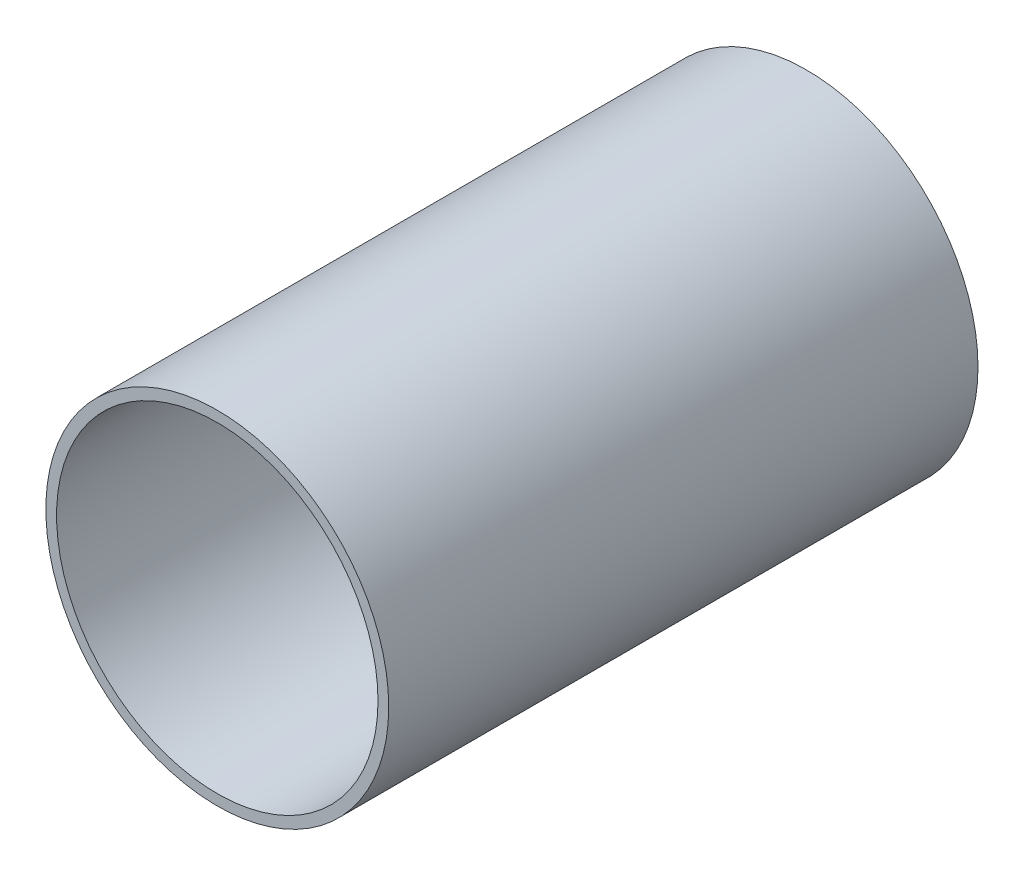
ISO-10303-21;
HEADER;
FILE_DESCRIPTION(('STEP AP214'),'2;1');
FILE_NAME('part.step','',(''),(''),'','','');
FILE_SCHEMA(('AUTOMOTIVE_DESIGN { 1 0 10303 214 1 1 1 1 }'));
ENDSEC;
DATA;
#1=APPLICATION_CONTEXT('core data for automotive mechanical design processes');
#2=APPLICATION_PROTOCOL_DEFINITION('international standard','automotive_design',2000,#1);
#3=PRODUCT_CONTEXT('',#1,'mechanical');
#4=PRODUCT('Part','Part','',(#3));
#5=PRODUCT_RELATED_PRODUCT_CATEGORY('part','',(#4));
#6=PRODUCT_DEFINITION_FORMATION('','',#4);
#7=PRODUCT_DEFINITION_CONTEXT('part definition',#1,'design');
#8=PRODUCT_DEFINITION('design','',#6,#7);
#9=PRODUCT_DEFINITION_SHAPE('','',#8);
#10=(LENGTH_UNIT() NAMED_UNIT(*) SI_UNIT(.MILLI.,.METRE.));
#11=(NAMED_UNIT(*) PLANE_ANGLE_UNIT() SI_UNIT($,.RADIAN.));
#12=(NAMED_UNIT(*) SI_UNIT($,.STERADIAN.) SOLID_ANGLE_UNIT());
#13=UNCERTAINTY_MEASURE_WITH_UNIT(LENGTH_MEASURE(1.E-05),#10,'distance_accuracy_value','');
#14=(GEOMETRIC_REPRESENTATION_CONTEXT(3) GLOBAL_UNCERTAINTY_ASSIGNED_CONTEXT((#13)) GLOBAL_UNIT_ASSIGNED_CONTEXT((#10,
#11,#12)) REPRESENTATION_CONTEXT('',''));
#15=CARTESIAN_POINT('',(0.,0.,0.));
#16=DIRECTION('',(0.,0.,1.));
#17=DIRECTION('',(1.,0.,0.));
#18=AXIS2_PLACEMENT_3D('',#15,#16,#17);
#19=CARTESIAN_POINT('',(0.,0.,22.));
#20=DIRECTION('',(0.,0.,1.));
#21=DIRECTION('',(1.,0.,0.));
#22=AXIS2_PLACEMENT_3D('',#19,#20,#21);
#23=PLANE('',#22);
#24=CARTESIAN_POINT('',(0.,0.,22.));
#25=DIRECTION('',(0.,0.,1.));
#26=DIRECTION('',(1.,0.,0.));
#27=AXIS2_PLACEMENT_3D('',#24,#25,#26);
#28=CIRCLE('',#27,6.4);
#29=CARTESIAN_POINT('',(6.4,0.,22.));
#30=VERTEX_POINT('',#29);
#31=EDGE_CURVE('E11',#30,#30,#28,.T.);
#32=ORIENTED_EDGE('',*,*,#31,.T.);
#33=EDGE_LOOP('',(#32));
#34=FACE_BOUND('',#33,.T.);
#35=CARTESIAN_POINT('',(0.,0.,22.));
#36=DIRECTION('',(0.,0.,1.));
#37=DIRECTION('',(1.,0.,0.));
#38=AXIS2_PLACEMENT_3D('',#35,#36,#37);
#39=CIRCLE('',#38,6.);
#40=CARTESIAN_POINT('',(6.,0.,22.));
#41=VERTEX_POINT('',#40);
#42=EDGE_CURVE('E47',#41,#41,#39,.T.);
#43=ORIENTED_EDGE('',*,*,#42,.F.);
#44=EDGE_LOOP('',(#43));
#45=FACE_BOUND('',#44,.T.);
#46=ADVANCED_FACE('F36',(#34,#45),#23,.T.);
#47=CARTESIAN_POINT('',(0.,0.,0.));
#48=DIRECTION('',(0.,0.,1.));
#49=DIRECTION('',(1.,0.,0.));
#50=AXIS2_PLACEMENT_3D('',#47,#48,#49);
#51=PLANE('',#50);
#52=CARTESIAN_POINT('',(0.,0.,0.));
#53=DIRECTION('',(0.,0.,1.));
#54=DIRECTION('',(1.,0.,0.));
#55=AXIS2_PLACEMENT_3D('',#52,#53,#54);
#56=CIRCLE('',#55,6.4);
#57=CARTESIAN_POINT('',(6.4,0.,0.));
#58=VERTEX_POINT('',#57);
#59=EDGE_CURVE('E40',#58,#58,#56,.T.);
#60=ORIENTED_EDGE('',*,*,#59,.F.);
#61=EDGE_LOOP('',(#60));
#62=FACE_BOUND('',#61,.T.);
#63=CARTESIAN_POINT('',(0.,0.,0.));
#64=DIRECTION('',(0.,0.,1.));
#65=DIRECTION('',(1.,0.,0.));
#66=AXIS2_PLACEMENT_3D('',#63,#64,#65);
#67=CIRCLE('',#66,6.);
#68=CARTESIAN_POINT('',(6.,0.,0.));
#69=VERTEX_POINT('',#68);
#70=EDGE_CURVE('E49',#69,#69,#67,.T.);
#71=ORIENTED_EDGE('',*,*,#70,.T.);
#72=EDGE_LOOP('',(#71));
#73=FACE_BOUND('',#72,.T.);
#74=ADVANCED_FACE('F59',(#62,#73),#51,.F.);
#75=CARTESIAN_POINT('',(0.,0.,22.));
#76=DIRECTION('',(0.,0.,-1.));
#77=DIRECTION('',(-1.,0.,0.));
#78=AXIS2_PLACEMENT_3D('',#75,#76,#77);
#79=CYLINDRICAL_SURFACE('',#78,6.4);
#80=ORIENTED_EDGE('',*,*,#31,.F.);
#81=EDGE_LOOP('',(#80));
#82=FACE_BOUND('',#81,.T.);
#83=ORIENTED_EDGE('',*,*,#59,.T.);
#84=EDGE_LOOP('',(#83));
#85=FACE_BOUND('',#84,.T.);
#86=ADVANCED_FACE('F38',(#82,#85),#79,.T.);
#87=CARTESIAN_POINT('',(0.,0.,22.));
#88=DIRECTION('',(0.,0.,-1.));
#89=DIRECTION('',(-1.,0.,0.));
#90=AXIS2_PLACEMENT_3D('',#87,#88,#89);
#91=CYLINDRICAL_SURFACE('',#90,6.);
#92=ORIENTED_EDGE('',*,*,#42,.T.);
#93=EDGE_LOOP('',(#92));
#94=FACE_BOUND('',#93,.T.);
#95=ORIENTED_EDGE('',*,*,#70,.F.);
#96=EDGE_LOOP('',(#95));
#97=FACE_BOUND('',#96,.T.);
#98=ADVANCED_FACE('F55',(#94,#97),#91,.F.);
#99=CLOSED_SHELL('',(#46,#74,#86,#98));
#100=MANIFOLD_SOLID_BREP('B2',#99);
#101=ADVANCED_BREP_SHAPE_REPRESENTATION('',(#18,#100),#14);
#102=SHAPE_DEFINITION_REPRESENTATION(#9,#101);
ENDSEC;
END-ISO-10303-21;
